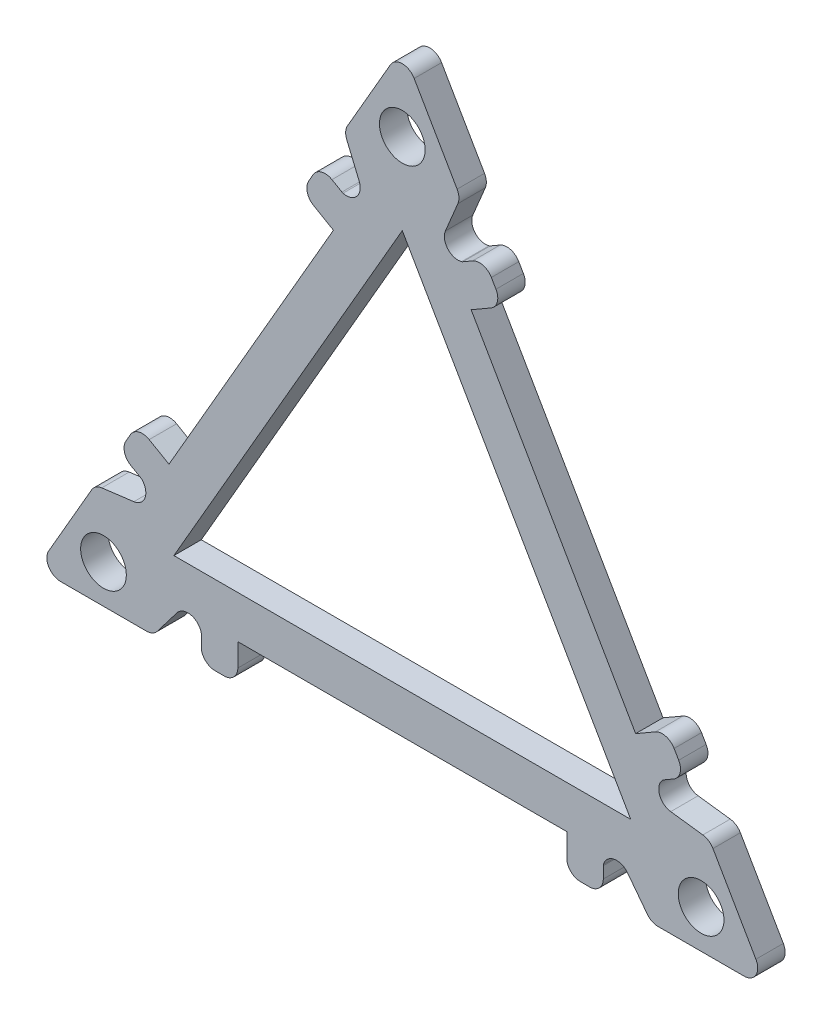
from build123d import *

# Parameters (mm, degrees)
SKETCH1_R           = 2.5
BOSS_EXTRUDE1_DEPTH = 3


with BuildPart() as part:
    # Sketch1 → Boss-Extrude1 (new body)
    with BuildSketch(Plane.XY):
        with BuildLine():
            Line((-37.401923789, -23.094010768), (-28, -23.094010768))
            ThreePointArc((-28, -23.094010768), (-27.334469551, -22.938283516), (-26.807127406, -22.503436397))
            Line((-26.807127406, -22.503436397), (-24.6580835, -19.684585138))
            ThreePointArc((-24.6580835, -19.684585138), (-23.176892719, -19.121980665), (-22.017394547, -20.201801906))
            ThreePointArc((-22.017394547, -20.201801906), (-22.004367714, -20.266593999), (-22, -20.332538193))
            Line((-22, -20.332538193), (-22, -21.594010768))
            ThreePointArc((-22, -21.594010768), (-21.560660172, -22.654670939), (-20.5, -23.094010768))
            Line((-20.5, -23.094010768), (-19.5, -23.094010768))
            ThreePointArc((-19.5, -23.094010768), (-18.439339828, -22.654670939), (-18, -21.594010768))
            Line((-18, -21.594010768), (-18, -19.094010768))
            Line((-18, -19.094010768), (18, -19.094010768))
            Line((18, -19.094010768), (18, -21.594010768))
            ThreePointArc((18, -21.594010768), (18.439339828, -22.654670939), (19.5, -23.094010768))
            Line((19.5, -23.094010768), (20.5, -23.094010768))
            ThreePointArc((20.5, -23.094010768), (21.560660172, -22.654670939), (22, -21.594010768))
            Line((22, -21.594010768), (22, -20.332538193))
            ThreePointArc((22, -20.332538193), (22.004367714, -20.266593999), (22.017394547, -20.201801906))
            ThreePointArc((22.017394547, -20.201801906), (23.176892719, -19.121980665), (24.6580835, -19.684585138))
            Line((24.6580835, -19.684585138), (26.807127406, -22.503436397))
            ThreePointArc((26.807127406, -22.503436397), (27.334469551, -22.938283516), (28, -23.094010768))
            Line((28, -23.094010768), (37.401923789, -23.094010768))
            ThreePointArc((37.401923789, -23.094010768), (38.700961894, -22.344010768), (38.700961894, -20.844010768))
            Line((38.700961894, -20.844010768), (34, -12.701705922))
            ThreePointArc((34, -12.701705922), (33.53237102, -12.203203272), (32.892111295, -11.963935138))
            Line((32.892111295, -11.963935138), (29.376392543, -11.51223415))
            ThreePointArc((29.376392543, -11.51223415), (28.148567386, -10.510787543), (28.503970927, -8.96672205))
            ThreePointArc((28.503970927, -8.96672205), (28.553569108, -8.923044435), (28.608494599, -8.886289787))
            Line((28.608494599, -8.886289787), (29.700961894, -8.255553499))
            ThreePointArc((29.700961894, -8.255553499), (30.399850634, -7.344743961), (30.25, -6.206515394))
            Line((30.25, -6.206515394), (29.75, -5.34048999))
            ThreePointArc((29.75, -5.34048999), (28.839190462, -4.641601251), (27.700961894, -4.791451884))
            Line((27.700961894, -4.791451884), (25.535898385, -6.041451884))
            Line((25.535898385, -6.041451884), (7.535898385, 25.135462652))
            Line((7.535898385, 25.135462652), (9.700961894, 26.385462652))
            ThreePointArc((9.700961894, 26.385462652), (10.399850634, 27.29627219), (10.25, 28.434500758))
            Line((10.25, 28.434500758), (9.75, 29.300526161))
            ThreePointArc((9.75, 29.300526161), (8.839190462, 29.999414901), (7.700961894, 29.849564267))
            Line((7.700961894, 29.849564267), (6.608494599, 29.21882798))
            ThreePointArc((6.608494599, 29.21882798), (6.549201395, 29.189638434), (6.48657638, 29.168523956))
            ThreePointArc((6.48657638, 29.168523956), (4.971674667, 29.632768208), (4.718309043, 31.196819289))
            Line((4.718309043, 31.196819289), (6.084983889, 34.467371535))
            ThreePointArc((6.084983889, 34.467371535), (6.197901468, 35.141486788), (6, 35.79571669))
            Line((6, 35.79571669), (1.299038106, 43.938021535))
            ThreePointArc((1.299038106, 43.938021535), (0, 44.688021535), (-1.299038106, 43.938021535))
            Line((-1.299038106, 43.938021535), (-6, 35.79571669))
            ThreePointArc((-6, 35.79571669), (-6.197901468, 35.141486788), (-6.084983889, 34.467371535))
            Line((-6.084983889, 34.467371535), (-4.718309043, 31.196819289))
            ThreePointArc((-4.718309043, 31.196819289), (-4.971674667, 29.632768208), (-6.48657638, 29.168523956))
            ThreePointArc((-6.48657638, 29.168523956), (-6.549201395, 29.189638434), (-6.608494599, 29.21882798))
            Line((-6.608494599, 29.21882798), (-7.700961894, 29.849564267))
            ThreePointArc((-7.700961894, 29.849564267), (-8.839190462, 29.999414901), (-9.75, 29.300526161))
            Line((-9.75, 29.300526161), (-10.25, 28.434500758))
            ThreePointArc((-10.25, 28.434500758), (-10.399850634, 27.29627219), (-9.700961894, 26.385462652))
            Line((-9.700961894, 26.385462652), (-7.535898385, 25.135462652))
            Line((-7.535898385, 25.135462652), (-25.535898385, -6.041451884))
            Line((-25.535898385, -6.041451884), (-27.700961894, -4.791451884))
            ThreePointArc((-27.700961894, -4.791451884), (-28.839190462, -4.641601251), (-29.75, -5.34048999))
            Line((-29.75, -5.34048999), (-30.25, -6.206515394))
            ThreePointArc((-30.25, -6.206515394), (-30.399850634, -7.344743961), (-29.700961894, -8.255553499))
            Line((-29.700961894, -8.255553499), (-28.608494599, -8.886289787))
            ThreePointArc((-28.608494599, -8.886289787), (-28.553569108, -8.923044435), (-28.503970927, -8.96672205))
            ThreePointArc((-28.503970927, -8.96672205), (-28.148567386, -10.510787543), (-29.376392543, -11.51223415))
            Line((-29.376392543, -11.51223415), (-32.892111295, -11.963935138))
            ThreePointArc((-32.892111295, -11.963935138), (-33.53237102, -12.203203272), (-34, -12.701705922))
            Line((-34, -12.701705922), (-38.700961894, -20.844010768))
            ThreePointArc((-38.700961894, -20.844010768), (-38.700961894, -22.344010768), (-37.401923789, -23.094010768))
        make_face()
        with Locations((-32.700961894, -18.879909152)):
            Circle(SKETCH1_R, mode=Mode.SUBTRACT)
        with Locations((32.700961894, -18.879909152)):
            Circle(SKETCH1_R, mode=Mode.SUBTRACT)
        with Locations((0, 37.759818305)):
            Circle(SKETCH1_R, mode=Mode.SUBTRACT)
        Polygon((-25, -14.43375673), (25, -14.43375673), (0, 28.867513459), align=None, mode=Mode.SUBTRACT)
    extrude(amount=BOSS_EXTRUDE1_DEPTH)


solid = part.part
